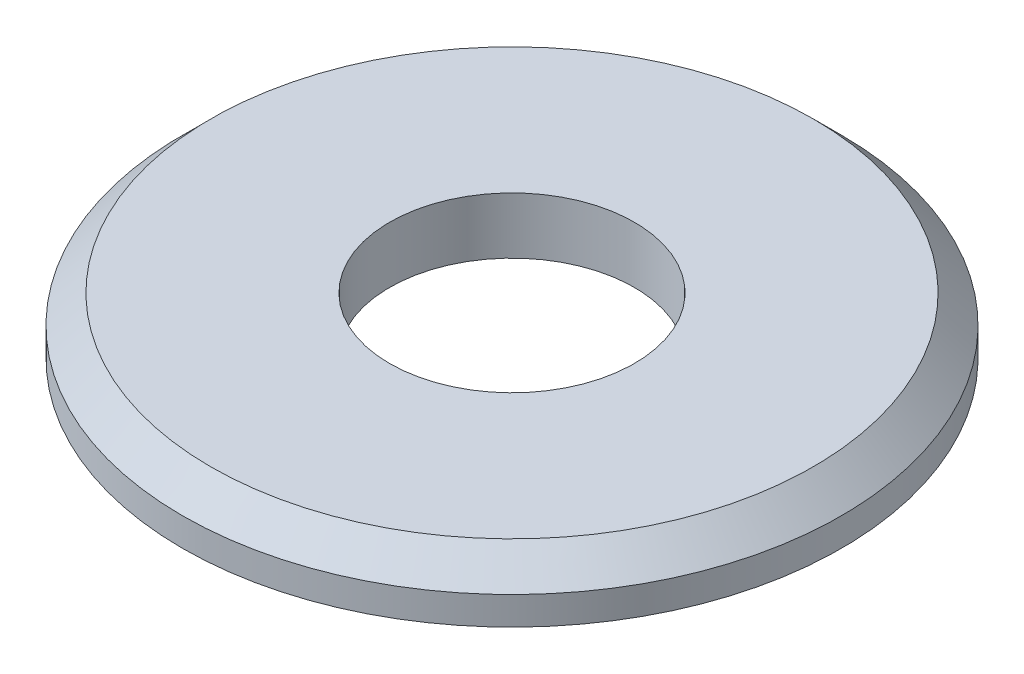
from build123d import *

# Parameters (mm, degrees)
SKETCH1_R      = 1.75
SKETCH1_R_2    = 0.65
EXTRUDE1_DEPTH = 0.3
CHAMFER1_SIZE  = 0.15


with BuildPart() as part:
    # Sketch1 → Extrude1 (new body)
    with BuildSketch(Plane(origin=(0, 0, 0), x_dir=(1, 0, 0), z_dir=(0, 1, 0))):
        with Locations(Location((0, 0, 0), (0, 0, 270))):
            Circle(SKETCH1_R)
        with Locations(Location((0, 0, 0), (0, 0, 270))):
            Circle(SKETCH1_R_2, mode=Mode.SUBTRACT)
    extrude(amount=EXTRUDE1_DEPTH)

    # Chamfer1
    chamfer1_edges = [part.edges().sort_by_distance(p)[0] for p in [
        (0, 0.3, -1.75),
    ]]
    chamfer(chamfer1_edges, length=CHAMFER1_SIZE)


solid = part.part
